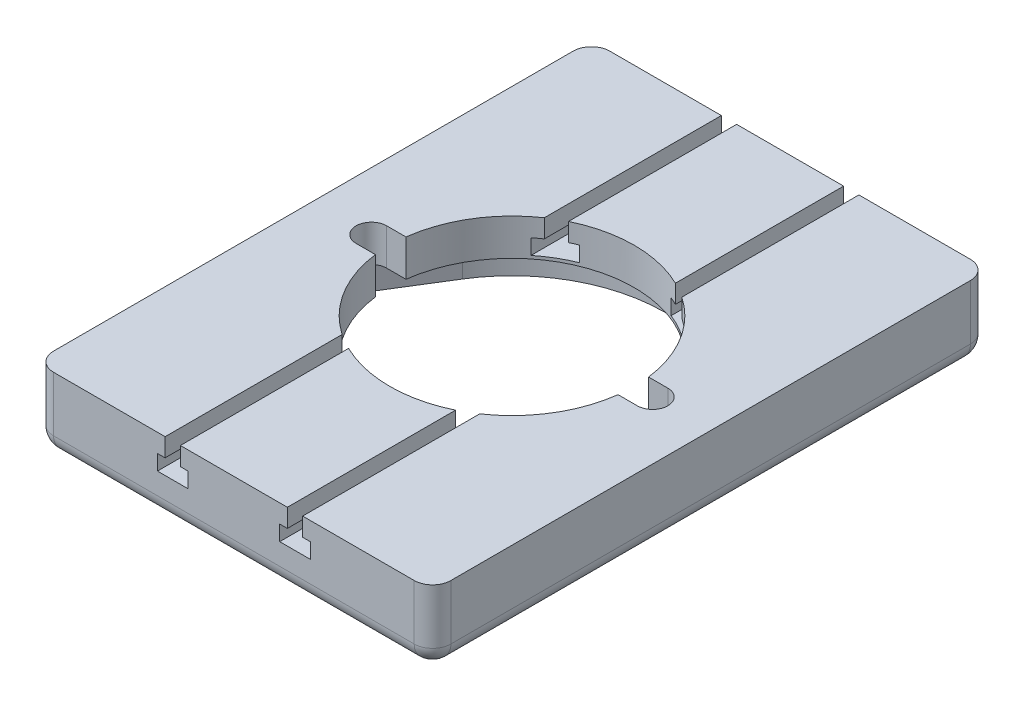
from build123d import *

# Parameters (mm, degrees)
ESQUISSE2_W             = 650
ESQUISSE2_H             = 910
BOSS_EXTRU_1_DEPTH      = 120
CONG_1_R                = 30
ENL_V_MAT_EXTRU_1_REACH = 573.883
ESQUISSE3_R             = 200
ENL_V_START             = -120
ENL_V_MAT_EXTRU_2_DEPTH = 120
ENL_V_MAT_EXTRU_3_DEPTH = 60
CONG_2_R                = 5
ENL_V_MAT_EXTRU_4_DEPTH = 974.717104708


with BuildPart() as part:
    # Esquisse2 → Boss.-Extru.1 (new body)
    with BuildSketch(Plane(origin=(0, 0, 0), x_dir=(1, 0, 0), z_dir=(0, 1, 0))):
        Rectangle(ESQUISSE2_W, ESQUISSE2_H)
    extrude(amount=-BOSS_EXTRU_1_DEPTH)

    # Cong_1
    cong_1_edges = [part.edges().sort_by_distance(p)[0] for p in [
        (-325, -120, 0),
        (0, -120, 455),
        (325, -120, 0),
        (0, -120, -455),
        (325, -60, 455),
        (-325, -60, 455),
        (-325, -60, -455),
        (325, -60, -455),
    ]]
    fillet(cong_1_edges, radius=CONG_1_R)

    # Esquisse3 → Enl_v. mat.-Extru.1 (cut, up to next)
    with BuildSketch(Plane(origin=(0, 0, 0), x_dir=(1, 0, 0), z_dir=(0, 1, 0)), mode=Mode.PRIVATE) as enl_v_mat_extru_1_sk1:
        with Locations(Location((0, 0, 0), (0, 0, 270))):
            Circle(ESQUISSE3_R)
    enl_v_mat_extru_1_tool1 = extrude(enl_v_mat_extru_1_sk1.sketch, amount=-ENL_V_MAT_EXTRU_1_REACH, mode=Mode.PRIVATE) & part.part
    add(enl_v_mat_extru_1_tool1.solids().sort_by_distance((0, 0, 0))[0], mode=Mode.SUBTRACT)

    # Esquisse4 → Enl_v. mat.-Extru.2 (cut)
    with BuildSketch(Plane(origin=(0, 0, 0), x_dir=(1, 0, 0), z_dir=(0, 1, 0)).offset(ENL_V_START)):
        with BuildLine():
            Line((-230, 25), (230, 25))
            ThreePointArc((230, 25), (255, 0), (230, -25))
            Line((230, -25), (-230, -25))
            ThreePointArc((-230, -25), (-255, 0), (-230, 25))
        make_face()
    extrude(amount=ENL_V_MAT_EXTRU_2_DEPTH, mode=Mode.SUBTRACT)

    # Esquisse5 → Enl_v. mat.-Extru.3 (cut)
    with BuildSketch(Plane.XZ.offset(120)):
        with BuildLine():
            Line((212.5, 131.695671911), (268, 42.142615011))
            ThreePointArc((268, 42.142615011), (280, 0), (268, -42.142615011))
            Line((268, -42.142615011), (212.5, -131.695671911))
            ThreePointArc((212.5, -131.695671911), (0, -250), (-212.5, -131.695671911))
            Line((-212.5, -131.695671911), (-268, -42.142615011))
            ThreePointArc((-268, -42.142615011), (-280, 0), (-268, 42.142615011))
            Line((-268, 42.142615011), (-212.5, 131.695671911))
            ThreePointArc((-212.5, 131.695671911), (0, 250), (212.5, 131.695671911))
        make_face()
    extrude(amount=-ENL_V_MAT_EXTRU_3_DEPTH, mode=Mode.SUBTRACT)

    # Cong_2
    cong_2_edges = [part.edges().sort_by_distance(p)[0] for p in [
        (0, -60, -250),
        (-240.25, -60, -86.919143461),
        (-280, -60, 0),
        (-240.25, -60, 86.919143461),
        (0, -60, 250),
        (240.25, -60, 86.919143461),
        (280, -60, 0),
        (240.25, -60, -86.919143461),
    ]]
    fillet(cong_2_edges, radius=CONG_2_R)

    # Esquisse6 → Enl_v. mat.-Extru.4 (cut, through all)
    with BuildSketch(Plane.XY.offset(455)):
        Polygon((112.5, 0), (87.5, 0), (87.5, -30), (75, -30), (75, -55), (125, -55), (125, -30), (112.5, -30), align=None)
        Polygon((-75, -30), (-75, -55), (-125, -55), (-125, -30), (-112.5, -30), (-112.5, 0), (-87.5, 0), (-87.5, -30), align=None)
    extrude(amount=-ENL_V_MAT_EXTRU_4_DEPTH, mode=Mode.SUBTRACT)


solid = part.part
